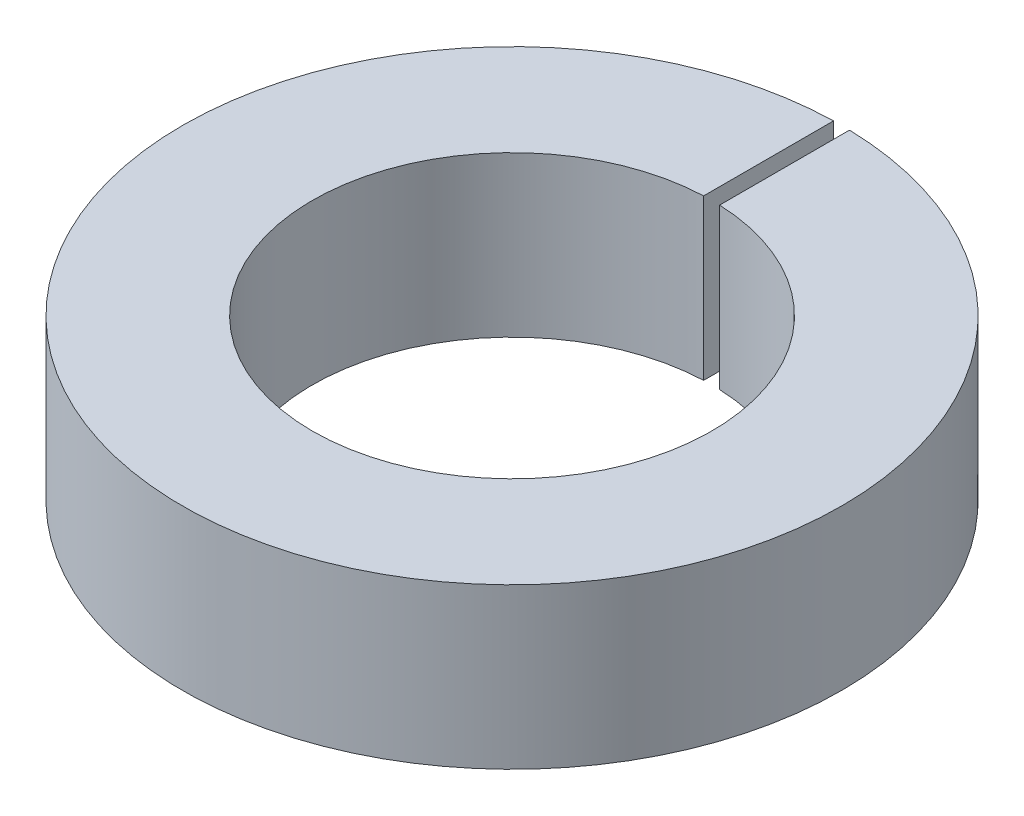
from build123d import *

# Parameters (mm, degrees)
SKETCH1_R          = 26.19375
SKETCH1_R_2        = 15.875
EXTRUDE1_DEPTH     = 12.7
SKETCH2_W          = 1.27
SKETCH2_H          = 50.8
CUT_EXTRUDE1_DEPTH = 40.160121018


with BuildPart() as part:
    # Sketch1 → Extrude1 (new body)
    with BuildSketch(Plane(origin=(0, 0, 0), x_dir=(1, 0, 0), z_dir=(0, 1, 0))):
        with Locations(Location((0, 0, 0), (0, 0, 270))):
            Circle(SKETCH1_R)
        with Locations(Location((0, 0, 0), (0, 0, 270))):
            Circle(SKETCH1_R_2, mode=Mode.SUBTRACT)
    extrude(amount=EXTRUDE1_DEPTH)

    # Sketch2 → Cut-Extrude1 (cut, through all)
    with BuildSketch(Plane(origin=(0, 12.7, 0), x_dir=(-1, 0, 0), z_dir=(0, 1, 0))):
        with Locations((0, -10.16)):
            Rectangle(SKETCH2_W, SKETCH2_H)
    extrude(amount=-CUT_EXTRUDE1_DEPTH, mode=Mode.SUBTRACT)


solid = part.part
